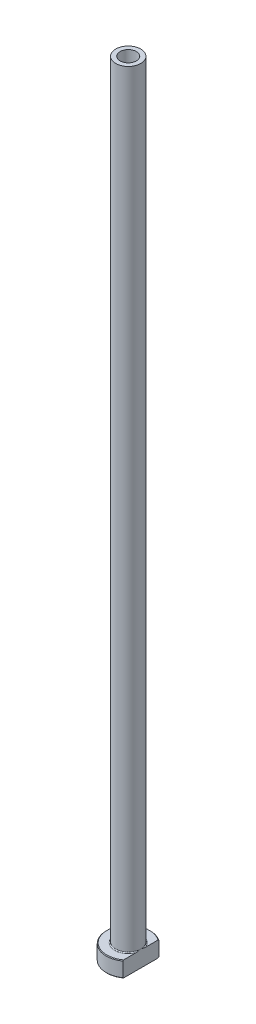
from build123d import *

# Parameters (mm, degrees)
FILLET1_R          = 0.3
CHAMFER1_SIZE      = 0.2
CUT_EXTRUDE1_DEPTH = 251.195923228
CHAMFER2_SIZE      = 0.5


with BuildPart() as part:
    # Sketch1 → Revolve1 (revolve)
    with BuildSketch(Plane.XY, mode=Mode.PRIVATE) as revolve1_sk:
        Polygon((-2.6, 250), (-4, 250), (-4, 5), (-7, 5), (-7, 0), (-2.85, 0), (-2.85, 193), (-2.6, 205), align=None)
    revolve(revolve1_sk.sketch.rotate(Axis((0, 92.187680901, 0), (0, -1, 0)), 270), axis=Axis((0, 92.187680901, 0), (0, -1, 0)))

    # Fillet1
    fillet1_edges = [part.edges().sort_by_distance(p)[0] for p in [
        (0, 5, -4),
    ]]
    fillet(fillet1_edges, radius=FILLET1_R)

    # Chamfer1
    chamfer1_edges = [part.edges().sort_by_distance(p)[0] for p in [
        (0, 0, -7),
        (0, 5, -7),
    ]]
    chamfer(chamfer1_edges, length=CHAMFER1_SIZE)

    # Sketch2 → Cut-Extrude1 (cut, through all)
    with BuildSketch(Plane.XZ):
        with BuildLine():
            Line((4, 5.744562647), (4, -5.744562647))
            ThreePointArc((4, -5.744562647), (7, 0), (4, 5.744562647))
        make_face()
    extrude(amount=-CUT_EXTRUDE1_DEPTH, mode=Mode.SUBTRACT)

    # Chamfer2
    chamfer2_edges = [part.edges().sort_by_distance(p)[0] for p in [
        (0, 0, -2.85),
    ]]
    chamfer(chamfer2_edges, length=CHAMFER2_SIZE)


solid = part.part
